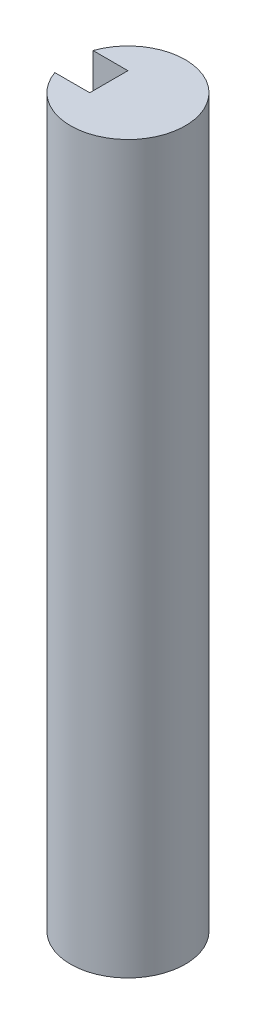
from build123d import *

# Parameters (mm, degrees)
SKETCH3_R           = 1.5
BOSS_EXTRUDE2_DEPTH = 19
SKETCH6_W           = 1
SKETCH6_H           = 1.5
CUT_EXTRUDE2_DEPTH  = 1


with BuildPart() as part:
    # Sketch3 → Boss-Extrude2 (new body)
    with BuildSketch(Plane(origin=(0, 0, 0), x_dir=(1, 0, 0), z_dir=(0, 1, 0))):
        with Locations(Location((1.5, 0, 0), (0, 0, 270))):
            Circle(SKETCH3_R)
    extrude(amount=BOSS_EXTRUDE2_DEPTH)

    # Sketch6 → Cut-Extrude2 (cut)
    with BuildSketch(Plane(origin=(0, 0, 0), x_dir=(0, 0, -1), z_dir=(1, 0, 0))):
        with Locations((0, 12.75)):
            Rectangle(SKETCH6_W, SKETCH6_H)
        with Locations((0, 9.75)):
            Rectangle(SKETCH6_W, SKETCH6_H)
        with Locations((0, 18.25)):
            Rectangle(SKETCH6_W, SKETCH6_H)
    extrude(amount=CUT_EXTRUDE2_DEPTH, mode=Mode.SUBTRACT)


solid = part.part
